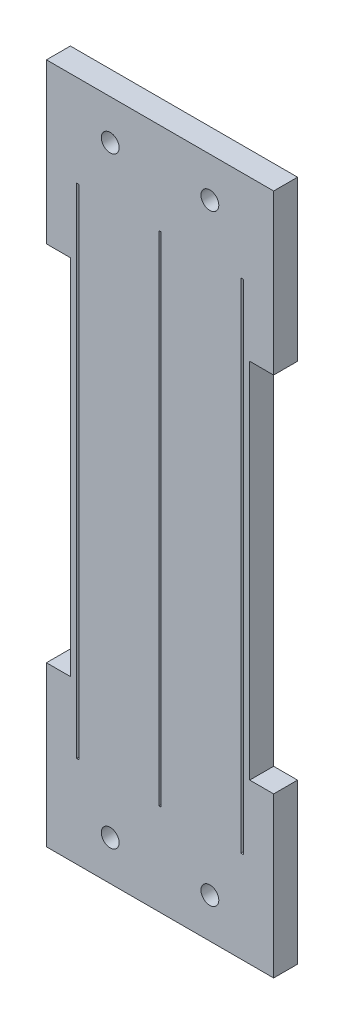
ISO-10303-21;
HEADER;
FILE_DESCRIPTION(('STEP AP214'),'2;1');
FILE_NAME('part.step','',(''),(''),'','','');
FILE_SCHEMA(('AUTOMOTIVE_DESIGN { 1 0 10303 214 1 1 1 1 }'));
ENDSEC;
DATA;
#1=APPLICATION_CONTEXT('core data for automotive mechanical design processes');
#2=APPLICATION_PROTOCOL_DEFINITION('international standard','automotive_design',2000,#1);
#3=PRODUCT_CONTEXT('',#1,'mechanical');
#4=PRODUCT('Part','Part','',(#3));
#5=PRODUCT_RELATED_PRODUCT_CATEGORY('part','',(#4));
#6=PRODUCT_DEFINITION_FORMATION('','',#4);
#7=PRODUCT_DEFINITION_CONTEXT('part definition',#1,'design');
#8=PRODUCT_DEFINITION('design','',#6,#7);
#9=PRODUCT_DEFINITION_SHAPE('','',#8);
#10=(LENGTH_UNIT() NAMED_UNIT(*) SI_UNIT(.MILLI.,.METRE.));
#11=(NAMED_UNIT(*) PLANE_ANGLE_UNIT() SI_UNIT($,.RADIAN.));
#12=(NAMED_UNIT(*) SI_UNIT($,.STERADIAN.) SOLID_ANGLE_UNIT());
#13=UNCERTAINTY_MEASURE_WITH_UNIT(LENGTH_MEASURE(1.E-05),#10,'distance_accuracy_value','');
#14=(GEOMETRIC_REPRESENTATION_CONTEXT(3) GLOBAL_UNCERTAINTY_ASSIGNED_CONTEXT((#13)) GLOBAL_UNIT_ASSIGNED_CONTEXT((#10,
#11,#12)) REPRESENTATION_CONTEXT('',''));
#15=CARTESIAN_POINT('',(0.,0.,0.));
#16=DIRECTION('',(0.,0.,1.));
#17=DIRECTION('',(1.,0.,0.));
#18=AXIS2_PLACEMENT_3D('',#15,#16,#17);
#19=CARTESIAN_POINT('',(0.,0.,6.));
#20=DIRECTION('',(0.,0.,1.));
#21=DIRECTION('',(1.,0.,0.));
#22=AXIS2_PLACEMENT_3D('',#19,#20,#21);
#23=PLANE('',#22);
#24=CARTESIAN_POINT('',(-12.5,75.5,6.));
#25=DIRECTION('',(0.,0.,-1.));
#26=DIRECTION('',(1.,0.,0.));
#27=AXIS2_PLACEMENT_3D('',#24,#25,#26);
#28=CIRCLE('',#27,2.23466812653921);
#29=CARTESIAN_POINT('',(-10.2653318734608,75.5,6.));
#30=VERTEX_POINT('',#29);
#31=EDGE_CURVE('E264',#30,#30,#28,.T.);
#32=ORIENTED_EDGE('',*,*,#31,.T.);
#33=EDGE_LOOP('',(#32));
#34=FACE_BOUND('',#33,.T.);
#35=DIRECTION('',(1.,0.,0.));
#36=VECTOR('',#35,1.);
#37=CARTESIAN_POINT('',(-22.5,-85.5,6.));
#38=LINE('',#37,#36);
#39=CARTESIAN_POINT('',(-28.5,-85.5,6.));
#40=VERTEX_POINT('',#39);
#41=CARTESIAN_POINT('',(28.5,-85.5,6.));
#42=VERTEX_POINT('',#41);
#43=EDGE_CURVE('E352',#40,#42,#38,.T.);
#44=ORIENTED_EDGE('',*,*,#43,.T.);
#45=DIRECTION('',(0.,1.,0.));
#46=VECTOR('',#45,1.);
#47=CARTESIAN_POINT('',(28.5,-85.5,6.));
#48=LINE('',#47,#46);
#49=CARTESIAN_POINT('',(28.5,-45.5,6.));
#50=VERTEX_POINT('',#49);
#51=EDGE_CURVE('E284',#42,#50,#48,.T.);
#52=ORIENTED_EDGE('',*,*,#51,.T.);
#53=DIRECTION('',(-1.,0.,0.));
#54=VECTOR('',#53,1.);
#55=CARTESIAN_POINT('',(22.5,-45.5,6.));
#56=LINE('',#55,#54);
#57=CARTESIAN_POINT('',(22.5,-45.5,6.));
#58=VERTEX_POINT('',#57);
#59=EDGE_CURVE('E294',#50,#58,#56,.T.);
#60=ORIENTED_EDGE('',*,*,#59,.T.);
#61=DIRECTION('',(0.,1.,0.));
#62=VECTOR('',#61,1.);
#63=CARTESIAN_POINT('',(22.5,85.5,6.));
#64=LINE('',#63,#62);
#65=CARTESIAN_POINT('',(22.5,45.5,6.));
#66=VERTEX_POINT('',#65);
#67=EDGE_CURVE('E346',#58,#66,#64,.T.);
#68=ORIENTED_EDGE('',*,*,#67,.T.);
#69=DIRECTION('',(-1.,0.,0.));
#70=VECTOR('',#69,1.);
#71=CARTESIAN_POINT('',(22.5,45.5,6.));
#72=LINE('',#71,#70);
#73=CARTESIAN_POINT('',(28.5,45.5,6.));
#74=VERTEX_POINT('',#73);
#75=EDGE_CURVE('E305',#74,#66,#72,.T.);
#76=ORIENTED_EDGE('',*,*,#75,.F.);
#77=DIRECTION('',(0.,-1.,0.));
#78=VECTOR('',#77,1.);
#79=CARTESIAN_POINT('',(28.5,85.5,6.));
#80=LINE('',#79,#78);
#81=CARTESIAN_POINT('',(28.5,85.5,6.));
#82=VERTEX_POINT('',#81);
#83=EDGE_CURVE('E314',#82,#74,#80,.T.);
#84=ORIENTED_EDGE('',*,*,#83,.F.);
#85=DIRECTION('',(-1.,0.,0.));
#86=VECTOR('',#85,1.);
#87=CARTESIAN_POINT('',(-22.5,85.5,6.));
#88=LINE('',#87,#86);
#89=CARTESIAN_POINT('',(-28.5,85.5,6.));
#90=VERTEX_POINT('',#89);
#91=EDGE_CURVE('E365',#82,#90,#88,.T.);
#92=ORIENTED_EDGE('',*,*,#91,.T.);
#93=DIRECTION('',(0.,-1.,0.));
#94=VECTOR('',#93,1.);
#95=CARTESIAN_POINT('',(-28.5,85.5,6.));
#96=LINE('',#95,#94);
#97=CARTESIAN_POINT('',(-28.5,45.5,6.));
#98=VERTEX_POINT('',#97);
#99=EDGE_CURVE('E379',#90,#98,#96,.T.);
#100=ORIENTED_EDGE('',*,*,#99,.T.);
#101=DIRECTION('',(1.,0.,0.));
#102=VECTOR('',#101,1.);
#103=CARTESIAN_POINT('',(-22.5,45.5,6.));
#104=LINE('',#103,#102);
#105=CARTESIAN_POINT('',(-22.5,45.5,6.));
#106=VERTEX_POINT('',#105);
#107=EDGE_CURVE('E382',#98,#106,#104,.T.);
#108=ORIENTED_EDGE('',*,*,#107,.T.);
#109=DIRECTION('',(0.,-1.,0.));
#110=VECTOR('',#109,1.);
#111=CARTESIAN_POINT('',(-22.5,85.5,6.));
#112=LINE('',#111,#110);
#113=CARTESIAN_POINT('',(-22.5,-45.5,6.));
#114=VERTEX_POINT('',#113);
#115=EDGE_CURVE('E362',#106,#114,#112,.T.);
#116=ORIENTED_EDGE('',*,*,#115,.T.);
#117=DIRECTION('',(1.,0.,0.));
#118=VECTOR('',#117,1.);
#119=CARTESIAN_POINT('',(-22.5,-45.5,6.));
#120=LINE('',#119,#118);
#121=CARTESIAN_POINT('',(-28.5,-45.5,6.));
#122=VERTEX_POINT('',#121);
#123=EDGE_CURVE('E270',#122,#114,#120,.T.);
#124=ORIENTED_EDGE('',*,*,#123,.F.);
#125=DIRECTION('',(0.,1.,0.));
#126=VECTOR('',#125,1.);
#127=CARTESIAN_POINT('',(-28.5,-85.5,6.));
#128=LINE('',#127,#126);
#129=EDGE_CURVE('E276',#40,#122,#128,.T.);
#130=ORIENTED_EDGE('',*,*,#129,.F.);
#131=EDGE_LOOP('',(#44,#52,#60,#68,#76,#84,#92,#100,#108,#116,#124,#130));
#132=FACE_BOUND('',#131,.T.);
#133=CARTESIAN_POINT('',(-12.5,-75.5,6.));
#134=DIRECTION('',(0.,0.,1.));
#135=DIRECTION('',(1.,0.,0.));
#136=AXIS2_PLACEMENT_3D('',#133,#134,#135);
#137=CIRCLE('',#136,2.23466812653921);
#138=CARTESIAN_POINT('',(-10.2653318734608,-75.5,6.));
#139=VERTEX_POINT('',#138);
#140=EDGE_CURVE('E387',#139,#139,#137,.T.);
#141=ORIENTED_EDGE('',*,*,#140,.F.);
#142=EDGE_LOOP('',(#141));
#143=FACE_BOUND('',#142,.T.);
#144=CARTESIAN_POINT('',(12.5,-75.5,6.));
#145=DIRECTION('',(0.,0.,-1.));
#146=DIRECTION('',(-1.,0.,0.));
#147=AXIS2_PLACEMENT_3D('',#144,#145,#146);
#148=CIRCLE('',#147,2.23466812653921);
#149=CARTESIAN_POINT('',(10.2653318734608,-75.5,6.));
#150=VERTEX_POINT('',#149);
#151=EDGE_CURVE('E319',#150,#150,#148,.T.);
#152=ORIENTED_EDGE('',*,*,#151,.T.);
#153=EDGE_LOOP('',(#152));
#154=FACE_BOUND('',#153,.T.);
#155=CARTESIAN_POINT('',(12.5,75.5,6.));
#156=DIRECTION('',(0.,0.,1.));
#157=DIRECTION('',(-1.,0.,0.));
#158=AXIS2_PLACEMENT_3D('',#155,#156,#157);
#159=CIRCLE('',#158,2.23466812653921);
#160=CARTESIAN_POINT('',(10.2653318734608,75.5,6.));
#161=VERTEX_POINT('',#160);
#162=EDGE_CURVE('E254',#161,#161,#159,.T.);
#163=ORIENTED_EDGE('',*,*,#162,.F.);
#164=EDGE_LOOP('',(#163));
#165=FACE_BOUND('',#164,.T.);
#166=DIRECTION('',(0.,1.,0.));
#167=VECTOR('',#166,1.);
#168=CARTESIAN_POINT('',(0.3,-62.5,6.));
#169=LINE('',#168,#167);
#170=CARTESIAN_POINT('',(0.3,-62.5,6.));
#171=VERTEX_POINT('',#170);
#172=CARTESIAN_POINT('',(0.3,62.5,6.));
#173=VERTEX_POINT('',#172);
#174=EDGE_CURVE('E234',#171,#173,#169,.T.);
#175=ORIENTED_EDGE('',*,*,#174,.F.);
#176=DIRECTION('',(1.,0.,0.));
#177=VECTOR('',#176,1.);
#178=CARTESIAN_POINT('',(-0.3,-62.5,6.));
#179=LINE('',#178,#177);
#180=CARTESIAN_POINT('',(-0.3,-62.5,6.));
#181=VERTEX_POINT('',#180);
#182=EDGE_CURVE('E248',#181,#171,#179,.T.);
#183=ORIENTED_EDGE('',*,*,#182,.F.);
#184=DIRECTION('',(0.,-1.,0.));
#185=VECTOR('',#184,1.);
#186=CARTESIAN_POINT('',(-0.3,-62.5,6.));
#187=LINE('',#186,#185);
#188=CARTESIAN_POINT('',(-0.3,62.5,6.));
#189=VERTEX_POINT('',#188);
#190=EDGE_CURVE('E245',#189,#181,#187,.T.);
#191=ORIENTED_EDGE('',*,*,#190,.F.);
#192=DIRECTION('',(-1.,0.,0.));
#193=VECTOR('',#192,1.);
#194=CARTESIAN_POINT('',(-0.3,62.5,6.));
#195=LINE('',#194,#193);
#196=EDGE_CURVE('E242',#173,#189,#195,.T.);
#197=ORIENTED_EDGE('',*,*,#196,.F.);
#198=EDGE_LOOP('',(#175,#183,#191,#197));
#199=FACE_BOUND('',#198,.T.);
#200=DIRECTION('',(0.,1.,0.));
#201=VECTOR('',#200,1.);
#202=CARTESIAN_POINT('',(-20.3,62.5,6.));
#203=LINE('',#202,#201);
#204=CARTESIAN_POINT('',(-20.3,-62.5,6.));
#205=VERTEX_POINT('',#204);
#206=CARTESIAN_POINT('',(-20.3,62.5,6.));
#207=VERTEX_POINT('',#206);
#208=EDGE_CURVE('E218',#205,#207,#203,.T.);
#209=ORIENTED_EDGE('',*,*,#208,.F.);
#210=DIRECTION('',(1.,0.,0.));
#211=VECTOR('',#210,1.);
#212=CARTESIAN_POINT('',(-20.9,-62.5,6.));
#213=LINE('',#212,#211);
#214=CARTESIAN_POINT('',(-20.9,-62.5,6.));
#215=VERTEX_POINT('',#214);
#216=EDGE_CURVE('E228',#215,#205,#213,.T.);
#217=ORIENTED_EDGE('',*,*,#216,.F.);
#218=DIRECTION('',(0.,-1.,0.));
#219=VECTOR('',#218,1.);
#220=CARTESIAN_POINT('',(-20.9,62.5,6.));
#221=LINE('',#220,#219);
#222=CARTESIAN_POINT('',(-20.9,62.5,6.));
#223=VERTEX_POINT('',#222);
#224=EDGE_CURVE('E225',#223,#215,#221,.T.);
#225=ORIENTED_EDGE('',*,*,#224,.F.);
#226=DIRECTION('',(-1.,0.,0.));
#227=VECTOR('',#226,1.);
#228=CARTESIAN_POINT('',(-20.9,62.5,6.));
#229=LINE('',#228,#227);
#230=EDGE_CURVE('E222',#207,#223,#229,.T.);
#231=ORIENTED_EDGE('',*,*,#230,.F.);
#232=EDGE_LOOP('',(#209,#217,#225,#231));
#233=FACE_BOUND('',#232,.T.);
#234=DIRECTION('',(-1.,0.,0.));
#235=VECTOR('',#234,1.);
#236=CARTESIAN_POINT('',(20.9,-62.5,6.));
#237=LINE('',#236,#235);
#238=CARTESIAN_POINT('',(20.9,-62.5,6.));
#239=VERTEX_POINT('',#238);
#240=CARTESIAN_POINT('',(20.3,-62.5,6.));
#241=VERTEX_POINT('',#240);
#242=EDGE_CURVE('E206',#239,#241,#237,.T.);
#243=ORIENTED_EDGE('',*,*,#242,.T.);
#244=DIRECTION('',(0.,1.,0.));
#245=VECTOR('',#244,1.);
#246=CARTESIAN_POINT('',(20.3,62.5,6.));
#247=LINE('',#246,#245);
#248=CARTESIAN_POINT('',(20.3,62.5,6.));
#249=VERTEX_POINT('',#248);
#250=EDGE_CURVE('E49',#241,#249,#247,.T.);
#251=ORIENTED_EDGE('',*,*,#250,.T.);
#252=DIRECTION('',(1.,0.,0.));
#253=VECTOR('',#252,1.);
#254=CARTESIAN_POINT('',(20.9,62.5,6.));
#255=LINE('',#254,#253);
#256=CARTESIAN_POINT('',(20.9,62.5,6.));
#257=VERTEX_POINT('',#256);
#258=EDGE_CURVE('E211',#249,#257,#255,.T.);
#259=ORIENTED_EDGE('',*,*,#258,.T.);
#260=DIRECTION('',(0.,-1.,0.));
#261=VECTOR('',#260,1.);
#262=CARTESIAN_POINT('',(20.9,62.5,6.));
#263=LINE('',#262,#261);
#264=EDGE_CURVE('E197',#257,#239,#263,.T.);
#265=ORIENTED_EDGE('',*,*,#264,.T.);
#266=EDGE_LOOP('',(#243,#251,#259,#265));
#267=FACE_BOUND('',#266,.T.);
#268=ADVANCED_FACE('F34',(#34,#132,#143,#154,#165,#199,#233,#267),#23,.T.);
#269=CARTESIAN_POINT('',(0.,0.,0.));
#270=DIRECTION('',(0.,0.,1.));
#271=DIRECTION('',(1.,0.,0.));
#272=AXIS2_PLACEMENT_3D('',#269,#270,#271);
#273=PLANE('',#272);
#274=CARTESIAN_POINT('',(-12.5,75.5,0.));
#275=DIRECTION('',(0.,0.,-1.));
#276=DIRECTION('',(1.,0.,0.));
#277=AXIS2_PLACEMENT_3D('',#274,#275,#276);
#278=CIRCLE('',#277,2.23466812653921);
#279=CARTESIAN_POINT('',(-10.2653318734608,75.5,0.));
#280=VERTEX_POINT('',#279);
#281=EDGE_CURVE('E267',#280,#280,#278,.T.);
#282=ORIENTED_EDGE('',*,*,#281,.F.);
#283=EDGE_LOOP('',(#282));
#284=FACE_BOUND('',#283,.T.);
#285=DIRECTION('',(0.,1.,0.));
#286=VECTOR('',#285,1.);
#287=CARTESIAN_POINT('',(22.5,85.5,0.));
#288=LINE('',#287,#286);
#289=CARTESIAN_POINT('',(22.5,-45.5,0.));
#290=VERTEX_POINT('',#289);
#291=CARTESIAN_POINT('',(22.5,45.5,0.));
#292=VERTEX_POINT('',#291);
#293=EDGE_CURVE('E341',#290,#292,#288,.T.);
#294=ORIENTED_EDGE('',*,*,#293,.F.);
#295=DIRECTION('',(-1.,0.,0.));
#296=VECTOR('',#295,1.);
#297=CARTESIAN_POINT('',(22.5,-45.5,0.));
#298=LINE('',#297,#296);
#299=CARTESIAN_POINT('',(28.5,-45.5,0.));
#300=VERTEX_POINT('',#299);
#301=EDGE_CURVE('E293',#300,#290,#298,.T.);
#302=ORIENTED_EDGE('',*,*,#301,.F.);
#303=DIRECTION('',(0.,1.,0.));
#304=VECTOR('',#303,1.);
#305=CARTESIAN_POINT('',(28.5,-85.5,0.));
#306=LINE('',#305,#304);
#307=CARTESIAN_POINT('',(28.5,-85.5,0.));
#308=VERTEX_POINT('',#307);
#309=EDGE_CURVE('E290',#308,#300,#306,.T.);
#310=ORIENTED_EDGE('',*,*,#309,.F.);
#311=DIRECTION('',(1.,0.,0.));
#312=VECTOR('',#311,1.);
#313=CARTESIAN_POINT('',(-22.5,-85.5,0.));
#314=LINE('',#313,#312);
#315=CARTESIAN_POINT('',(-28.5,-85.5,0.));
#316=VERTEX_POINT('',#315);
#317=EDGE_CURVE('E358',#316,#308,#314,.T.);
#318=ORIENTED_EDGE('',*,*,#317,.F.);
#319=DIRECTION('',(0.,1.,0.));
#320=VECTOR('',#319,1.);
#321=CARTESIAN_POINT('',(-28.5,-85.5,0.));
#322=LINE('',#321,#320);
#323=CARTESIAN_POINT('',(-28.5,-45.5,0.));
#324=VERTEX_POINT('',#323);
#325=EDGE_CURVE('E275',#316,#324,#322,.T.);
#326=ORIENTED_EDGE('',*,*,#325,.T.);
#327=DIRECTION('',(1.,0.,0.));
#328=VECTOR('',#327,1.);
#329=CARTESIAN_POINT('',(-22.5,-45.5,0.));
#330=LINE('',#329,#328);
#331=CARTESIAN_POINT('',(-22.5,-45.5,0.));
#332=VERTEX_POINT('',#331);
#333=EDGE_CURVE('E273',#324,#332,#330,.T.);
#334=ORIENTED_EDGE('',*,*,#333,.T.);
#335=DIRECTION('',(0.,-1.,0.));
#336=VECTOR('',#335,1.);
#337=CARTESIAN_POINT('',(-22.5,85.5,0.));
#338=LINE('',#337,#336);
#339=CARTESIAN_POINT('',(-22.5,45.5,0.));
#340=VERTEX_POINT('',#339);
#341=EDGE_CURVE('E355',#340,#332,#338,.T.);
#342=ORIENTED_EDGE('',*,*,#341,.F.);
#343=DIRECTION('',(1.,0.,0.));
#344=VECTOR('',#343,1.);
#345=CARTESIAN_POINT('',(-22.5,45.5,0.));
#346=LINE('',#345,#344);
#347=CARTESIAN_POINT('',(-28.5,45.5,0.));
#348=VERTEX_POINT('',#347);
#349=EDGE_CURVE('E376',#348,#340,#346,.T.);
#350=ORIENTED_EDGE('',*,*,#349,.F.);
#351=DIRECTION('',(0.,-1.,0.));
#352=VECTOR('',#351,1.);
#353=CARTESIAN_POINT('',(-28.5,85.5,0.));
#354=LINE('',#353,#352);
#355=CARTESIAN_POINT('',(-28.5,85.5,0.));
#356=VERTEX_POINT('',#355);
#357=EDGE_CURVE('E384',#356,#348,#354,.T.);
#358=ORIENTED_EDGE('',*,*,#357,.F.);
#359=DIRECTION('',(-1.,0.,0.));
#360=VECTOR('',#359,1.);
#361=CARTESIAN_POINT('',(-22.5,85.5,0.));
#362=LINE('',#361,#360);
#363=CARTESIAN_POINT('',(28.5,85.5,0.));
#364=VERTEX_POINT('',#363);
#365=EDGE_CURVE('E344',#364,#356,#362,.T.);
#366=ORIENTED_EDGE('',*,*,#365,.F.);
#367=DIRECTION('',(0.,-1.,0.));
#368=VECTOR('',#367,1.);
#369=CARTESIAN_POINT('',(28.5,85.5,0.));
#370=LINE('',#369,#368);
#371=CARTESIAN_POINT('',(28.5,45.5,0.));
#372=VERTEX_POINT('',#371);
#373=EDGE_CURVE('E310',#364,#372,#370,.T.);
#374=ORIENTED_EDGE('',*,*,#373,.T.);
#375=DIRECTION('',(-1.,0.,0.));
#376=VECTOR('',#375,1.);
#377=CARTESIAN_POINT('',(22.5,45.5,0.));
#378=LINE('',#377,#376);
#379=EDGE_CURVE('E313',#372,#292,#378,.T.);
#380=ORIENTED_EDGE('',*,*,#379,.T.);
#381=EDGE_LOOP('',(#294,#302,#310,#318,#326,#334,#342,#350,#358,#366,#374,#380));
#382=FACE_BOUND('',#381,.T.);
#383=CARTESIAN_POINT('',(-12.5,-75.5,0.));
#384=DIRECTION('',(0.,0.,1.));
#385=DIRECTION('',(1.,0.,0.));
#386=AXIS2_PLACEMENT_3D('',#383,#384,#385);
#387=CIRCLE('',#386,2.23466812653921);
#388=CARTESIAN_POINT('',(-10.2653318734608,-75.5,0.));
#389=VERTEX_POINT('',#388);
#390=EDGE_CURVE('E383',#389,#389,#387,.T.);
#391=ORIENTED_EDGE('',*,*,#390,.T.);
#392=EDGE_LOOP('',(#391));
#393=FACE_BOUND('',#392,.T.);
#394=CARTESIAN_POINT('',(12.5,-75.5,0.));
#395=DIRECTION('',(0.,0.,-1.));
#396=DIRECTION('',(-1.,0.,0.));
#397=AXIS2_PLACEMENT_3D('',#394,#395,#396);
#398=CIRCLE('',#397,2.23466812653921);
#399=CARTESIAN_POINT('',(10.2653318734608,-75.5,0.));
#400=VERTEX_POINT('',#399);
#401=EDGE_CURVE('E325',#400,#400,#398,.T.);
#402=ORIENTED_EDGE('',*,*,#401,.F.);
#403=EDGE_LOOP('',(#402));
#404=FACE_BOUND('',#403,.T.);
#405=CARTESIAN_POINT('',(12.5,75.5,0.));
#406=DIRECTION('',(0.,0.,1.));
#407=DIRECTION('',(-1.,0.,0.));
#408=AXIS2_PLACEMENT_3D('',#405,#406,#407);
#409=CIRCLE('',#408,2.23466812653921);
#410=CARTESIAN_POINT('',(10.2653318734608,75.5,0.));
#411=VERTEX_POINT('',#410);
#412=EDGE_CURVE('E261',#411,#411,#409,.T.);
#413=ORIENTED_EDGE('',*,*,#412,.T.);
#414=EDGE_LOOP('',(#413));
#415=FACE_BOUND('',#414,.T.);
#416=DIRECTION('',(1.,0.,0.));
#417=VECTOR('',#416,1.);
#418=CARTESIAN_POINT('',(0.,-62.5,0.));
#419=LINE('',#418,#417);
#420=CARTESIAN_POINT('',(-0.3,-62.5,0.));
#421=VERTEX_POINT('',#420);
#422=CARTESIAN_POINT('',(0.3,-62.5,0.));
#423=VERTEX_POINT('',#422);
#424=EDGE_CURVE('E412',#421,#423,#419,.T.);
#425=ORIENTED_EDGE('',*,*,#424,.T.);
#426=DIRECTION('',(0.,1.,0.));
#427=VECTOR('',#426,1.);
#428=CARTESIAN_POINT('',(0.3,0.,0.));
#429=LINE('',#428,#427);
#430=CARTESIAN_POINT('',(0.3,62.5,0.));
#431=VERTEX_POINT('',#430);
#432=EDGE_CURVE('E436',#423,#431,#429,.T.);
#433=ORIENTED_EDGE('',*,*,#432,.T.);
#434=DIRECTION('',(-1.,0.,0.));
#435=VECTOR('',#434,1.);
#436=CARTESIAN_POINT('',(0.,62.5,0.));
#437=LINE('',#436,#435);
#438=CARTESIAN_POINT('',(-0.3,62.5,0.));
#439=VERTEX_POINT('',#438);
#440=EDGE_CURVE('E440',#431,#439,#437,.T.);
#441=ORIENTED_EDGE('',*,*,#440,.T.);
#442=DIRECTION('',(0.,-1.,0.));
#443=VECTOR('',#442,1.);
#444=CARTESIAN_POINT('',(-0.3,0.,0.));
#445=LINE('',#444,#443);
#446=EDGE_CURVE('E439',#439,#421,#445,.T.);
#447=ORIENTED_EDGE('',*,*,#446,.T.);
#448=EDGE_LOOP('',(#425,#433,#441,#447));
#449=FACE_BOUND('',#448,.T.);
#450=DIRECTION('',(1.,0.,0.));
#451=VECTOR('',#450,1.);
#452=CARTESIAN_POINT('',(0.,-62.5,0.));
#453=LINE('',#452,#451);
#454=CARTESIAN_POINT('',(-20.9,-62.5,0.));
#455=VERTEX_POINT('',#454);
#456=CARTESIAN_POINT('',(-20.3,-62.5,0.));
#457=VERTEX_POINT('',#456);
#458=EDGE_CURVE('E417',#455,#457,#453,.T.);
#459=ORIENTED_EDGE('',*,*,#458,.T.);
#460=DIRECTION('',(0.,1.,0.));
#461=VECTOR('',#460,1.);
#462=CARTESIAN_POINT('',(-20.3,0.,0.));
#463=LINE('',#462,#461);
#464=CARTESIAN_POINT('',(-20.3,62.5,0.));
#465=VERTEX_POINT('',#464);
#466=EDGE_CURVE('E426',#457,#465,#463,.T.);
#467=ORIENTED_EDGE('',*,*,#466,.T.);
#468=DIRECTION('',(-1.,0.,0.));
#469=VECTOR('',#468,1.);
#470=CARTESIAN_POINT('',(0.,62.5,0.));
#471=LINE('',#470,#469);
#472=CARTESIAN_POINT('',(-20.9,62.5,0.));
#473=VERTEX_POINT('',#472);
#474=EDGE_CURVE('E433',#465,#473,#471,.T.);
#475=ORIENTED_EDGE('',*,*,#474,.T.);
#476=DIRECTION('',(0.,-1.,0.));
#477=VECTOR('',#476,1.);
#478=CARTESIAN_POINT('',(-20.9,0.,0.));
#479=LINE('',#478,#477);
#480=EDGE_CURVE('E431',#473,#455,#479,.T.);
#481=ORIENTED_EDGE('',*,*,#480,.T.);
#482=EDGE_LOOP('',(#459,#467,#475,#481));
#483=FACE_BOUND('',#482,.T.);
#484=DIRECTION('',(0.,1.,0.));
#485=VECTOR('',#484,1.);
#486=CARTESIAN_POINT('',(20.3,0.,0.));
#487=LINE('',#486,#485);
#488=CARTESIAN_POINT('',(20.3,-62.5,0.));
#489=VERTEX_POINT('',#488);
#490=CARTESIAN_POINT('',(20.3,62.5,0.));
#491=VERTEX_POINT('',#490);
#492=EDGE_CURVE('E11',#489,#491,#487,.T.);
#493=ORIENTED_EDGE('',*,*,#492,.F.);
#494=DIRECTION('',(-1.,0.,0.));
#495=VECTOR('',#494,1.);
#496=CARTESIAN_POINT('',(0.,-62.5,0.));
#497=LINE('',#496,#495);
#498=CARTESIAN_POINT('',(20.9,-62.5,0.));
#499=VERTEX_POINT('',#498);
#500=EDGE_CURVE('E420',#499,#489,#497,.T.);
#501=ORIENTED_EDGE('',*,*,#500,.F.);
#502=DIRECTION('',(0.,-1.,0.));
#503=VECTOR('',#502,1.);
#504=CARTESIAN_POINT('',(20.9,0.,0.));
#505=LINE('',#504,#503);
#506=CARTESIAN_POINT('',(20.9,62.5,0.));
#507=VERTEX_POINT('',#506);
#508=EDGE_CURVE('E200',#507,#499,#505,.T.);
#509=ORIENTED_EDGE('',*,*,#508,.F.);
#510=DIRECTION('',(1.,0.,0.));
#511=VECTOR('',#510,1.);
#512=CARTESIAN_POINT('',(0.,62.5,0.));
#513=LINE('',#512,#511);
#514=EDGE_CURVE('E42',#491,#507,#513,.T.);
#515=ORIENTED_EDGE('',*,*,#514,.F.);
#516=EDGE_LOOP('',(#493,#501,#509,#515));
#517=FACE_BOUND('',#516,.T.);
#518=ADVANCED_FACE('F400',(#284,#382,#393,#404,#415,#449,#483,#517),#273,.F.);
#519=CARTESIAN_POINT('',(-22.5,85.5,6.));
#520=DIRECTION('',(1.,0.,0.));
#521=DIRECTION('',(0.,1.,0.));
#522=AXIS2_PLACEMENT_3D('',#519,#520,#521);
#523=PLANE('',#522);
#524=DIRECTION('',(0.,0.,1.));
#525=VECTOR('',#524,1.);
#526=CARTESIAN_POINT('',(-22.5,-45.5,0.));
#527=LINE('',#526,#525);
#528=EDGE_CURVE('E278',#332,#114,#527,.T.);
#529=ORIENTED_EDGE('',*,*,#528,.T.);
#530=ORIENTED_EDGE('',*,*,#115,.F.);
#531=DIRECTION('',(0.,0.,1.));
#532=VECTOR('',#531,1.);
#533=CARTESIAN_POINT('',(-22.5,45.5,0.));
#534=LINE('',#533,#532);
#535=EDGE_CURVE('E345',#340,#106,#534,.T.);
#536=ORIENTED_EDGE('',*,*,#535,.F.);
#537=ORIENTED_EDGE('',*,*,#341,.T.);
#538=EDGE_LOOP('',(#529,#530,#536,#537));
#539=FACE_BOUND('',#538,.T.);
#540=ADVANCED_FACE('F403',(#539),#523,.F.);
#541=CARTESIAN_POINT('',(22.5,85.5,6.));
#542=DIRECTION('',(-1.,0.,0.));
#543=DIRECTION('',(0.,-1.,0.));
#544=AXIS2_PLACEMENT_3D('',#541,#542,#543);
#545=PLANE('',#544);
#546=ORIENTED_EDGE('',*,*,#67,.F.);
#547=DIRECTION('',(0.,0.,1.));
#548=VECTOR('',#547,1.);
#549=CARTESIAN_POINT('',(22.5,-45.5,0.));
#550=LINE('',#549,#548);
#551=EDGE_CURVE('E302',#290,#58,#550,.T.);
#552=ORIENTED_EDGE('',*,*,#551,.F.);
#553=ORIENTED_EDGE('',*,*,#293,.T.);
#554=DIRECTION('',(0.,0.,1.));
#555=VECTOR('',#554,1.);
#556=CARTESIAN_POINT('',(22.5,45.5,0.));
#557=LINE('',#556,#555);
#558=EDGE_CURVE('E312',#292,#66,#557,.T.);
#559=ORIENTED_EDGE('',*,*,#558,.T.);
#560=EDGE_LOOP('',(#546,#552,#553,#559));
#561=FACE_BOUND('',#560,.T.);
#562=ADVANCED_FACE('F36',(#561),#545,.F.);
#563=CARTESIAN_POINT('',(-22.5,85.5,6.));
#564=DIRECTION('',(0.,-1.,0.));
#565=DIRECTION('',(0.,0.,-1.));
#566=AXIS2_PLACEMENT_3D('',#563,#564,#565);
#567=PLANE('',#566);
#568=ORIENTED_EDGE('',*,*,#365,.T.);
#569=DIRECTION('',(0.,0.,1.));
#570=VECTOR('',#569,1.);
#571=CARTESIAN_POINT('',(-28.5,85.5,0.));
#572=LINE('',#571,#570);
#573=EDGE_CURVE('E372',#356,#90,#572,.T.);
#574=ORIENTED_EDGE('',*,*,#573,.T.);
#575=ORIENTED_EDGE('',*,*,#91,.F.);
#576=DIRECTION('',(0.,0.,1.));
#577=VECTOR('',#576,1.);
#578=CARTESIAN_POINT('',(28.5,85.5,0.));
#579=LINE('',#578,#577);
#580=EDGE_CURVE('E316',#364,#82,#579,.T.);
#581=ORIENTED_EDGE('',*,*,#580,.F.);
#582=EDGE_LOOP('',(#568,#574,#575,#581));
#583=FACE_BOUND('',#582,.T.);
#584=ADVANCED_FACE('F479',(#583),#567,.F.);
#585=CARTESIAN_POINT('',(-22.5,-85.5,6.));
#586=DIRECTION('',(0.,1.,0.));
#587=DIRECTION('',(0.,0.,1.));
#588=AXIS2_PLACEMENT_3D('',#585,#586,#587);
#589=PLANE('',#588);
#590=ORIENTED_EDGE('',*,*,#317,.T.);
#591=DIRECTION('',(0.,0.,1.));
#592=VECTOR('',#591,1.);
#593=CARTESIAN_POINT('',(28.5,-85.5,0.));
#594=LINE('',#593,#592);
#595=EDGE_CURVE('E297',#308,#42,#594,.T.);
#596=ORIENTED_EDGE('',*,*,#595,.T.);
#597=ORIENTED_EDGE('',*,*,#43,.F.);
#598=DIRECTION('',(0.,0.,1.));
#599=VECTOR('',#598,1.);
#600=CARTESIAN_POINT('',(-28.5,-85.5,0.));
#601=LINE('',#600,#599);
#602=EDGE_CURVE('E281',#316,#40,#601,.T.);
#603=ORIENTED_EDGE('',*,*,#602,.F.);
#604=EDGE_LOOP('',(#590,#596,#597,#603));
#605=FACE_BOUND('',#604,.T.);
#606=ADVANCED_FACE('F451',(#605),#589,.F.);
#607=CARTESIAN_POINT('',(-22.5,45.5,0.));
#608=DIRECTION('',(0.,-1.,0.));
#609=DIRECTION('',(1.,0.,0.));
#610=AXIS2_PLACEMENT_3D('',#607,#608,#609);
#611=PLANE('',#610);
#612=ORIENTED_EDGE('',*,*,#107,.F.);
#613=DIRECTION('',(0.,0.,1.));
#614=VECTOR('',#613,1.);
#615=CARTESIAN_POINT('',(-28.5,45.5,0.));
#616=LINE('',#615,#614);
#617=EDGE_CURVE('E375',#348,#98,#616,.T.);
#618=ORIENTED_EDGE('',*,*,#617,.F.);
#619=ORIENTED_EDGE('',*,*,#349,.T.);
#620=ORIENTED_EDGE('',*,*,#535,.T.);
#621=EDGE_LOOP('',(#612,#618,#619,#620));
#622=FACE_BOUND('',#621,.T.);
#623=ADVANCED_FACE('F485',(#622),#611,.T.);
#624=CARTESIAN_POINT('',(-28.5,85.5,0.));
#625=DIRECTION('',(-1.,0.,0.));
#626=DIRECTION('',(0.,-1.,0.));
#627=AXIS2_PLACEMENT_3D('',#624,#625,#626);
#628=PLANE('',#627);
#629=ORIENTED_EDGE('',*,*,#99,.F.);
#630=ORIENTED_EDGE('',*,*,#573,.F.);
#631=ORIENTED_EDGE('',*,*,#357,.T.);
#632=ORIENTED_EDGE('',*,*,#617,.T.);
#633=EDGE_LOOP('',(#629,#630,#631,#632));
#634=FACE_BOUND('',#633,.T.);
#635=ADVANCED_FACE('F481',(#634),#628,.T.);
#636=CARTESIAN_POINT('',(-12.5,-75.5,0.));
#637=DIRECTION('',(0.,0.,1.));
#638=DIRECTION('',(1.,0.,0.));
#639=AXIS2_PLACEMENT_3D('',#636,#637,#638);
#640=CYLINDRICAL_SURFACE('',#639,2.23466812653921);
#641=ORIENTED_EDGE('',*,*,#390,.F.);
#642=EDGE_LOOP('',(#641));
#643=FACE_BOUND('',#642,.T.);
#644=ORIENTED_EDGE('',*,*,#140,.T.);
#645=EDGE_LOOP('',(#644));
#646=FACE_BOUND('',#645,.T.);
#647=ADVANCED_FACE('F728',(#643,#646),#640,.F.);
#648=CARTESIAN_POINT('',(12.5,-75.5,0.));
#649=DIRECTION('',(0.,0.,1.));
#650=DIRECTION('',(1.,0.,0.));
#651=AXIS2_PLACEMENT_3D('',#648,#649,#650);
#652=CYLINDRICAL_SURFACE('',#651,2.23466812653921);
#653=ORIENTED_EDGE('',*,*,#401,.T.);
#654=EDGE_LOOP('',(#653));
#655=FACE_BOUND('',#654,.T.);
#656=ORIENTED_EDGE('',*,*,#151,.F.);
#657=EDGE_LOOP('',(#656));
#658=FACE_BOUND('',#657,.T.);
#659=ADVANCED_FACE('F397',(#655,#658),#652,.F.);
#660=CARTESIAN_POINT('',(28.5,85.5,0.));
#661=DIRECTION('',(-1.,0.,0.));
#662=DIRECTION('',(0.,-1.,0.));
#663=AXIS2_PLACEMENT_3D('',#660,#661,#662);
#664=PLANE('',#663);
#665=ORIENTED_EDGE('',*,*,#83,.T.);
#666=DIRECTION('',(0.,0.,1.));
#667=VECTOR('',#666,1.);
#668=CARTESIAN_POINT('',(28.5,45.5,0.));
#669=LINE('',#668,#667);
#670=EDGE_CURVE('E320',#372,#74,#669,.T.);
#671=ORIENTED_EDGE('',*,*,#670,.F.);
#672=ORIENTED_EDGE('',*,*,#373,.F.);
#673=ORIENTED_EDGE('',*,*,#580,.T.);
#674=EDGE_LOOP('',(#665,#671,#672,#673));
#675=FACE_BOUND('',#674,.T.);
#676=ADVANCED_FACE('F473',(#675),#664,.F.);
#677=CARTESIAN_POINT('',(22.5,45.5,0.));
#678=DIRECTION('',(0.,1.,0.));
#679=DIRECTION('',(-1.,0.,0.));
#680=AXIS2_PLACEMENT_3D('',#677,#678,#679);
#681=PLANE('',#680);
#682=ORIENTED_EDGE('',*,*,#75,.T.);
#683=ORIENTED_EDGE('',*,*,#558,.F.);
#684=ORIENTED_EDGE('',*,*,#379,.F.);
#685=ORIENTED_EDGE('',*,*,#670,.T.);
#686=EDGE_LOOP('',(#682,#683,#684,#685));
#687=FACE_BOUND('',#686,.T.);
#688=ADVANCED_FACE('F463',(#687),#681,.F.);
#689=CARTESIAN_POINT('',(22.5,-45.5,0.));
#690=DIRECTION('',(0.,1.,0.));
#691=DIRECTION('',(-1.,0.,0.));
#692=AXIS2_PLACEMENT_3D('',#689,#690,#691);
#693=PLANE('',#692);
#694=ORIENTED_EDGE('',*,*,#59,.F.);
#695=DIRECTION('',(0.,0.,1.));
#696=VECTOR('',#695,1.);
#697=CARTESIAN_POINT('',(28.5,-45.5,0.));
#698=LINE('',#697,#696);
#699=EDGE_CURVE('E306',#300,#50,#698,.T.);
#700=ORIENTED_EDGE('',*,*,#699,.F.);
#701=ORIENTED_EDGE('',*,*,#301,.T.);
#702=ORIENTED_EDGE('',*,*,#551,.T.);
#703=EDGE_LOOP('',(#694,#700,#701,#702));
#704=FACE_BOUND('',#703,.T.);
#705=ADVANCED_FACE('F457',(#704),#693,.T.);
#706=CARTESIAN_POINT('',(28.5,-85.5,0.));
#707=DIRECTION('',(1.,0.,0.));
#708=DIRECTION('',(0.,1.,0.));
#709=AXIS2_PLACEMENT_3D('',#706,#707,#708);
#710=PLANE('',#709);
#711=ORIENTED_EDGE('',*,*,#51,.F.);
#712=ORIENTED_EDGE('',*,*,#595,.F.);
#713=ORIENTED_EDGE('',*,*,#309,.T.);
#714=ORIENTED_EDGE('',*,*,#699,.T.);
#715=EDGE_LOOP('',(#711,#712,#713,#714));
#716=FACE_BOUND('',#715,.T.);
#717=ADVANCED_FACE('F454',(#716),#710,.T.);
#718=CARTESIAN_POINT('',(-28.5,-85.5,0.));
#719=DIRECTION('',(1.,0.,0.));
#720=DIRECTION('',(0.,1.,0.));
#721=AXIS2_PLACEMENT_3D('',#718,#719,#720);
#722=PLANE('',#721);
#723=ORIENTED_EDGE('',*,*,#129,.T.);
#724=DIRECTION('',(0.,0.,1.));
#725=VECTOR('',#724,1.);
#726=CARTESIAN_POINT('',(-28.5,-45.5,0.));
#727=LINE('',#726,#725);
#728=EDGE_CURVE('E285',#324,#122,#727,.T.);
#729=ORIENTED_EDGE('',*,*,#728,.F.);
#730=ORIENTED_EDGE('',*,*,#325,.F.);
#731=ORIENTED_EDGE('',*,*,#602,.T.);
#732=EDGE_LOOP('',(#723,#729,#730,#731));
#733=FACE_BOUND('',#732,.T.);
#734=ADVANCED_FACE('F498',(#733),#722,.F.);
#735=CARTESIAN_POINT('',(-22.5,-45.5,0.));
#736=DIRECTION('',(0.,-1.,0.));
#737=DIRECTION('',(1.,0.,0.));
#738=AXIS2_PLACEMENT_3D('',#735,#736,#737);
#739=PLANE('',#738);
#740=ORIENTED_EDGE('',*,*,#123,.T.);
#741=ORIENTED_EDGE('',*,*,#528,.F.);
#742=ORIENTED_EDGE('',*,*,#333,.F.);
#743=ORIENTED_EDGE('',*,*,#728,.T.);
#744=EDGE_LOOP('',(#740,#741,#742,#743));
#745=FACE_BOUND('',#744,.T.);
#746=ADVANCED_FACE('F494',(#745),#739,.F.);
#747=CARTESIAN_POINT('',(-12.5,75.5,0.));
#748=DIRECTION('',(0.,0.,1.));
#749=DIRECTION('',(1.,0.,0.));
#750=AXIS2_PLACEMENT_3D('',#747,#748,#749);
#751=CYLINDRICAL_SURFACE('',#750,2.23466812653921);
#752=ORIENTED_EDGE('',*,*,#281,.T.);
#753=EDGE_LOOP('',(#752));
#754=FACE_BOUND('',#753,.T.);
#755=ORIENTED_EDGE('',*,*,#31,.F.);
#756=EDGE_LOOP('',(#755));
#757=FACE_BOUND('',#756,.T.);
#758=ADVANCED_FACE('F505',(#754,#757),#751,.F.);
#759=CARTESIAN_POINT('',(12.5,75.5,0.));
#760=DIRECTION('',(0.,0.,1.));
#761=DIRECTION('',(1.,0.,0.));
#762=AXIS2_PLACEMENT_3D('',#759,#760,#761);
#763=CYLINDRICAL_SURFACE('',#762,2.23466812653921);
#764=ORIENTED_EDGE('',*,*,#412,.F.);
#765=EDGE_LOOP('',(#764));
#766=FACE_BOUND('',#765,.T.);
#767=ORIENTED_EDGE('',*,*,#162,.T.);
#768=EDGE_LOOP('',(#767));
#769=FACE_BOUND('',#768,.T.);
#770=ADVANCED_FACE('F609',(#766,#769),#763,.F.);
#771=CARTESIAN_POINT('',(0.3,-62.5,-4.));
#772=DIRECTION('',(1.,0.,0.));
#773=DIRECTION('',(0.,0.,-1.));
#774=AXIS2_PLACEMENT_3D('',#771,#772,#773);
#775=PLANE('',#774);
#776=DIRECTION('',(0.,0.,1.));
#777=VECTOR('',#776,1.);
#778=CARTESIAN_POINT('',(0.3,-62.5,-4.));
#779=LINE('',#778,#777);
#780=EDGE_CURVE('E252',#423,#171,#779,.T.);
#781=ORIENTED_EDGE('',*,*,#780,.T.);
#782=ORIENTED_EDGE('',*,*,#174,.T.);
#783=DIRECTION('',(0.,0.,1.));
#784=VECTOR('',#783,1.);
#785=CARTESIAN_POINT('',(0.3,62.5,-4.));
#786=LINE('',#785,#784);
#787=EDGE_CURVE('E251',#431,#173,#786,.T.);
#788=ORIENTED_EDGE('',*,*,#787,.F.);
#789=ORIENTED_EDGE('',*,*,#432,.F.);
#790=EDGE_LOOP('',(#781,#782,#788,#789));
#791=FACE_BOUND('',#790,.T.);
#792=ADVANCED_FACE('F599',(#791),#775,.F.);
#793=CARTESIAN_POINT('',(-0.3,-62.5,-4.));
#794=DIRECTION('',(0.,-1.,0.));
#795=DIRECTION('',(0.,0.,-1.));
#796=AXIS2_PLACEMENT_3D('',#793,#794,#795);
#797=PLANE('',#796);
#798=DIRECTION('',(0.,0.,1.));
#799=VECTOR('',#798,1.);
#800=CARTESIAN_POINT('',(-0.3,-62.5,-4.));
#801=LINE('',#800,#799);
#802=EDGE_CURVE('E255',#421,#181,#801,.T.);
#803=ORIENTED_EDGE('',*,*,#802,.T.);
#804=ORIENTED_EDGE('',*,*,#182,.T.);
#805=ORIENTED_EDGE('',*,*,#780,.F.);
#806=ORIENTED_EDGE('',*,*,#424,.F.);
#807=EDGE_LOOP('',(#803,#804,#805,#806));
#808=FACE_BOUND('',#807,.T.);
#809=ADVANCED_FACE('F595',(#808),#797,.F.);
#810=CARTESIAN_POINT('',(-0.3,-62.5,-4.));
#811=DIRECTION('',(-1.,0.,0.));
#812=DIRECTION('',(0.,0.,1.));
#813=AXIS2_PLACEMENT_3D('',#810,#811,#812);
#814=PLANE('',#813);
#815=DIRECTION('',(0.,0.,1.));
#816=VECTOR('',#815,1.);
#817=CARTESIAN_POINT('',(-0.3,62.5,-4.));
#818=LINE('',#817,#816);
#819=EDGE_CURVE('E257',#439,#189,#818,.T.);
#820=ORIENTED_EDGE('',*,*,#819,.T.);
#821=ORIENTED_EDGE('',*,*,#190,.T.);
#822=ORIENTED_EDGE('',*,*,#802,.F.);
#823=ORIENTED_EDGE('',*,*,#446,.F.);
#824=EDGE_LOOP('',(#820,#821,#822,#823));
#825=FACE_BOUND('',#824,.T.);
#826=ADVANCED_FACE('F598',(#825),#814,.F.);
#827=CARTESIAN_POINT('',(-0.3,62.5,-4.));
#828=DIRECTION('',(0.,1.,0.));
#829=DIRECTION('',(0.,0.,1.));
#830=AXIS2_PLACEMENT_3D('',#827,#828,#829);
#831=PLANE('',#830);
#832=ORIENTED_EDGE('',*,*,#787,.T.);
#833=ORIENTED_EDGE('',*,*,#196,.T.);
#834=ORIENTED_EDGE('',*,*,#819,.F.);
#835=ORIENTED_EDGE('',*,*,#440,.F.);
#836=EDGE_LOOP('',(#832,#833,#834,#835));
#837=FACE_BOUND('',#836,.T.);
#838=ADVANCED_FACE('F593',(#837),#831,.F.);
#839=CARTESIAN_POINT('',(-20.3,62.5,-4.));
#840=DIRECTION('',(1.,0.,0.));
#841=DIRECTION('',(0.,1.,0.));
#842=AXIS2_PLACEMENT_3D('',#839,#840,#841);
#843=PLANE('',#842);
#844=DIRECTION('',(0.,0.,1.));
#845=VECTOR('',#844,1.);
#846=CARTESIAN_POINT('',(-20.3,-62.5,-4.));
#847=LINE('',#846,#845);
#848=EDGE_CURVE('E232',#457,#205,#847,.T.);
#849=ORIENTED_EDGE('',*,*,#848,.T.);
#850=ORIENTED_EDGE('',*,*,#208,.T.);
#851=DIRECTION('',(0.,0.,1.));
#852=VECTOR('',#851,1.);
#853=CARTESIAN_POINT('',(-20.3,62.5,-4.));
#854=LINE('',#853,#852);
#855=EDGE_CURVE('E231',#465,#207,#854,.T.);
#856=ORIENTED_EDGE('',*,*,#855,.F.);
#857=ORIENTED_EDGE('',*,*,#466,.F.);
#858=EDGE_LOOP('',(#849,#850,#856,#857));
#859=FACE_BOUND('',#858,.T.);
#860=ADVANCED_FACE('F584',(#859),#843,.F.);
#861=CARTESIAN_POINT('',(-20.9,-62.5,-4.));
#862=DIRECTION('',(0.,-1.,0.));
#863=DIRECTION('',(0.,0.,-1.));
#864=AXIS2_PLACEMENT_3D('',#861,#862,#863);
#865=PLANE('',#864);
#866=DIRECTION('',(0.,0.,1.));
#867=VECTOR('',#866,1.);
#868=CARTESIAN_POINT('',(-20.9,-62.5,-4.));
#869=LINE('',#868,#867);
#870=EDGE_CURVE('E235',#455,#215,#869,.T.);
#871=ORIENTED_EDGE('',*,*,#870,.T.);
#872=ORIENTED_EDGE('',*,*,#216,.T.);
#873=ORIENTED_EDGE('',*,*,#848,.F.);
#874=ORIENTED_EDGE('',*,*,#458,.F.);
#875=EDGE_LOOP('',(#871,#872,#873,#874));
#876=FACE_BOUND('',#875,.T.);
#877=ADVANCED_FACE('F580',(#876),#865,.F.);
#878=CARTESIAN_POINT('',(-20.9,62.5,-4.));
#879=DIRECTION('',(-1.,0.,0.));
#880=DIRECTION('',(0.,-1.,0.));
#881=AXIS2_PLACEMENT_3D('',#878,#879,#880);
#882=PLANE('',#881);
#883=DIRECTION('',(0.,0.,1.));
#884=VECTOR('',#883,1.);
#885=CARTESIAN_POINT('',(-20.9,62.5,-4.));
#886=LINE('',#885,#884);
#887=EDGE_CURVE('E237',#473,#223,#886,.T.);
#888=ORIENTED_EDGE('',*,*,#887,.T.);
#889=ORIENTED_EDGE('',*,*,#224,.T.);
#890=ORIENTED_EDGE('',*,*,#870,.F.);
#891=ORIENTED_EDGE('',*,*,#480,.F.);
#892=EDGE_LOOP('',(#888,#889,#890,#891));
#893=FACE_BOUND('',#892,.T.);
#894=ADVANCED_FACE('F583',(#893),#882,.F.);
#895=CARTESIAN_POINT('',(-20.9,62.5,-4.));
#896=DIRECTION('',(0.,1.,0.));
#897=DIRECTION('',(0.,0.,1.));
#898=AXIS2_PLACEMENT_3D('',#895,#896,#897);
#899=PLANE('',#898);
#900=ORIENTED_EDGE('',*,*,#855,.T.);
#901=ORIENTED_EDGE('',*,*,#230,.T.);
#902=ORIENTED_EDGE('',*,*,#887,.F.);
#903=ORIENTED_EDGE('',*,*,#474,.F.);
#904=EDGE_LOOP('',(#900,#901,#902,#903));
#905=FACE_BOUND('',#904,.T.);
#906=ADVANCED_FACE('F550',(#905),#899,.F.);
#907=CARTESIAN_POINT('',(20.3,62.5,-4.));
#908=DIRECTION('',(1.,0.,0.));
#909=DIRECTION('',(0.,1.,0.));
#910=AXIS2_PLACEMENT_3D('',#907,#908,#909);
#911=PLANE('',#910);
#912=ORIENTED_EDGE('',*,*,#492,.T.);
#913=DIRECTION('',(0.,0.,1.));
#914=VECTOR('',#913,1.);
#915=CARTESIAN_POINT('',(20.3,62.5,-4.));
#916=LINE('',#915,#914);
#917=EDGE_CURVE('E216',#491,#249,#916,.T.);
#918=ORIENTED_EDGE('',*,*,#917,.T.);
#919=ORIENTED_EDGE('',*,*,#250,.F.);
#920=DIRECTION('',(0.,0.,1.));
#921=VECTOR('',#920,1.);
#922=CARTESIAN_POINT('',(20.3,-62.5,-4.));
#923=LINE('',#922,#921);
#924=EDGE_CURVE('E203',#489,#241,#923,.T.);
#925=ORIENTED_EDGE('',*,*,#924,.F.);
#926=EDGE_LOOP('',(#912,#918,#919,#925));
#927=FACE_BOUND('',#926,.T.);
#928=ADVANCED_FACE('F422',(#927),#911,.T.);
#929=CARTESIAN_POINT('',(20.9,62.5,-4.));
#930=DIRECTION('',(0.,-1.,0.));
#931=DIRECTION('',(0.,0.,-1.));
#932=AXIS2_PLACEMENT_3D('',#929,#930,#931);
#933=PLANE('',#932);
#934=ORIENTED_EDGE('',*,*,#514,.T.);
#935=DIRECTION('',(0.,0.,1.));
#936=VECTOR('',#935,1.);
#937=CARTESIAN_POINT('',(20.9,62.5,-4.));
#938=LINE('',#937,#936);
#939=EDGE_CURVE('E202',#507,#257,#938,.T.);
#940=ORIENTED_EDGE('',*,*,#939,.T.);
#941=ORIENTED_EDGE('',*,*,#258,.F.);
#942=ORIENTED_EDGE('',*,*,#917,.F.);
#943=EDGE_LOOP('',(#934,#940,#941,#942));
#944=FACE_BOUND('',#943,.T.);
#945=ADVANCED_FACE('F424',(#944),#933,.T.);
#946=CARTESIAN_POINT('',(20.9,62.5,-4.));
#947=DIRECTION('',(-1.,0.,0.));
#948=DIRECTION('',(0.,-1.,0.));
#949=AXIS2_PLACEMENT_3D('',#946,#947,#948);
#950=PLANE('',#949);
#951=ORIENTED_EDGE('',*,*,#508,.T.);
#952=DIRECTION('',(0.,0.,1.));
#953=VECTOR('',#952,1.);
#954=CARTESIAN_POINT('',(20.9,-62.5,-4.));
#955=LINE('',#954,#953);
#956=EDGE_CURVE('E57',#499,#239,#955,.T.);
#957=ORIENTED_EDGE('',*,*,#956,.T.);
#958=ORIENTED_EDGE('',*,*,#264,.F.);
#959=ORIENTED_EDGE('',*,*,#939,.F.);
#960=EDGE_LOOP('',(#951,#957,#958,#959));
#961=FACE_BOUND('',#960,.T.);
#962=ADVANCED_FACE('F194',(#961),#950,.T.);
#963=CARTESIAN_POINT('',(20.9,-62.5,-4.));
#964=DIRECTION('',(0.,1.,0.));
#965=DIRECTION('',(0.,0.,1.));
#966=AXIS2_PLACEMENT_3D('',#963,#964,#965);
#967=PLANE('',#966);
#968=ORIENTED_EDGE('',*,*,#500,.T.);
#969=ORIENTED_EDGE('',*,*,#924,.T.);
#970=ORIENTED_EDGE('',*,*,#242,.F.);
#971=ORIENTED_EDGE('',*,*,#956,.F.);
#972=EDGE_LOOP('',(#968,#969,#970,#971));
#973=FACE_BOUND('',#972,.T.);
#974=ADVANCED_FACE('F207',(#973),#967,.T.);
#975=CLOSED_SHELL('',(#268,#518,#540,#562,#584,#606,#623,#635,#647,#659,#676,#688,#705,#717,
#734,#746,#758,#770,#792,#809,#826,#838,#860,#877,#894,#906,#928,#945,#962,#974));
#976=MANIFOLD_SOLID_BREP('B2',#975);
#977=ADVANCED_BREP_SHAPE_REPRESENTATION('',(#18,#976),#14);
#978=SHAPE_DEFINITION_REPRESENTATION(#9,#977);
ENDSEC;
END-ISO-10303-21;
